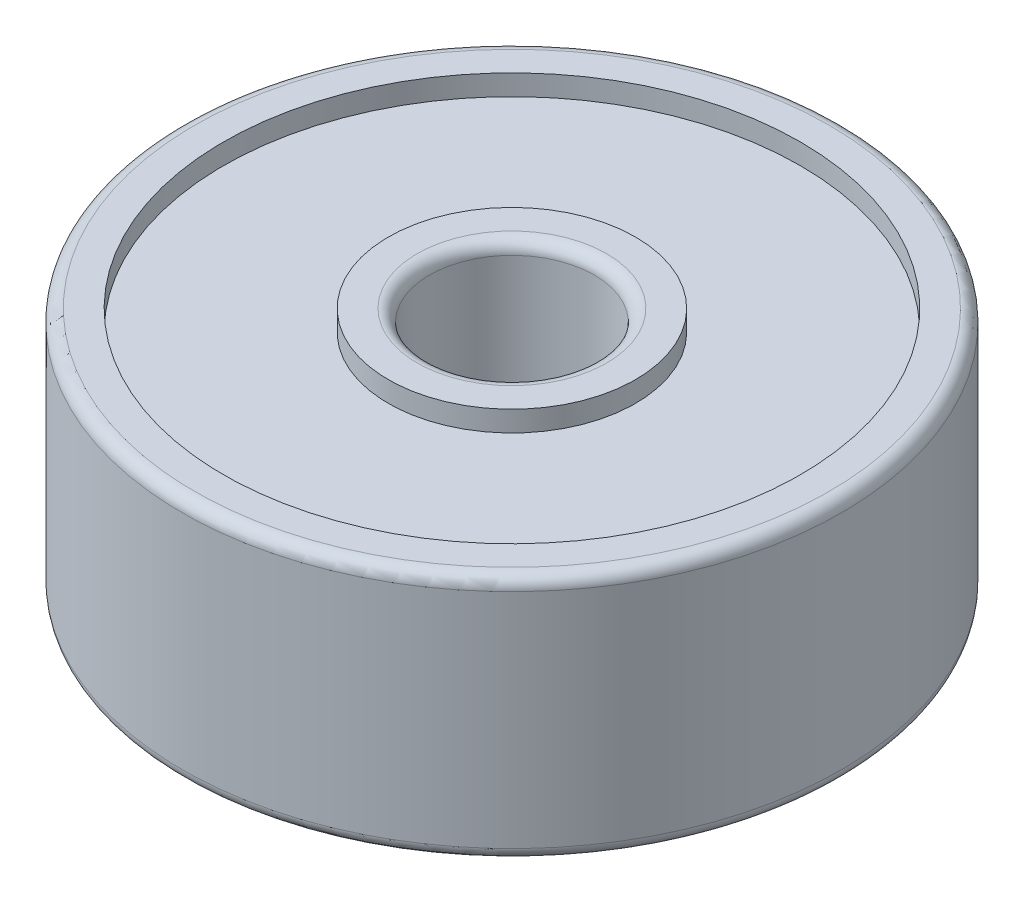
from build123d import *


with BuildPart() as part:
    # Sketch 1 → Revolve 1 (revolve)
    with BuildSketch(Plane.XY, mode=Mode.PRIVATE) as revolve_1_sk:
        with BuildLine():
            Line((-2, -2.7), (-2, 2.7))
            ThreePointArc((-2, 2.7), (-2.087867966, 2.912132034), (-2.3, 3))
            Line((-2.3, 3), (-3, 3))
            Line((-3, 3), (-3, 2.5))
            Line((-3, 2.5), (-7, 2.5))
            Line((-7, 2.5), (-7, 3))
            Line((-7, 3), (-7.7, 3))
            ThreePointArc((-7.7, 3), (-7.912132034, 2.912132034), (-8, 2.7))
            Line((-8, 2.7), (-8, -2.7))
            ThreePointArc((-8, -2.7), (-7.912132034, -2.912132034), (-7.7, -3))
            Line((-7.7, -3), (-7, -3))
            Line((-7, -3), (-7, -2.5))
            Line((-7, -2.5), (-3, -2.5))
            Line((-3, -2.5), (-3, -3))
            Line((-3, -3), (-2.3, -3))
            ThreePointArc((-2.3, -3), (-2.087867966, -2.912132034), (-2, -2.7))
        make_face()
    revolve(revolve_1_sk.sketch.rotate(Axis((0, 0, 0), (0, 1, 0)), 270), axis=Axis((0, 0, 0), (0, 1, 0)))


solid = part.part
